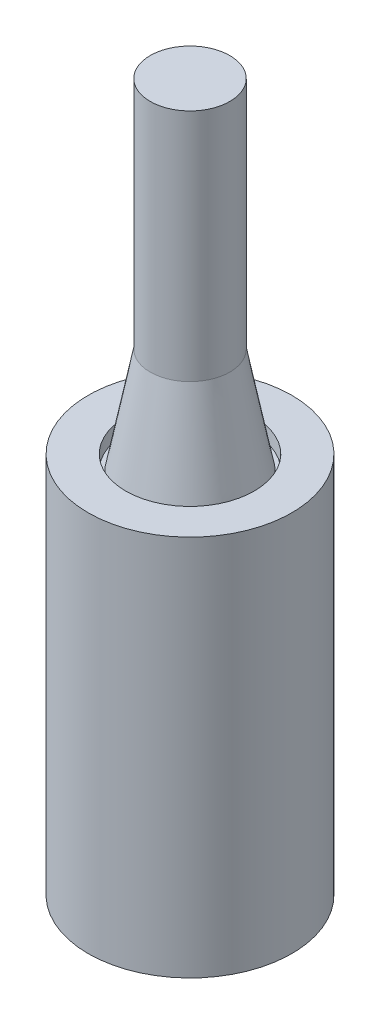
from build123d import *

# Parameters (mm, degrees)
SKETCH1_R      = 7.75
EXTRUDE1_DEPTH = 18.923
SKETCH2_R      = 6.55
EXTRUDE2_DEPTH = 11.43
EXTRUDE2_TAPER = 11
SKETCH3_R      = 4.328233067
EXTRUDE3_DEPTH = 25.5
SKETCH4_R      = 2.3114
EXTRUDE4_DEPTH = 6.35
SKETCH5_R      = 1.3716
EXTRUDE5_DEPTH = 6.35
SKETCH6_R      = 1.5875
EXTRUDE6_DEPTH = 12.7


with BuildPart() as part:
    # Sketch1 → Extrude1 (new body)
    with BuildSketch(Plane(origin=(0, 0, 0), x_dir=(1, 0, 0), z_dir=(0, 1, 0))):
        with Locations(Location((0, 0, 0), (0, 0, 270))):
            Circle(SKETCH1_R)
    extrude(amount=EXTRUDE1_DEPTH)

    # Sketch2 → Extrude2 (add)
    with BuildSketch(Plane(origin=(0, 18.923, 0), x_dir=(1, 0, 0), z_dir=(0, 1, 0))):
        Circle(SKETCH2_R)
    extrude(amount=EXTRUDE2_DEPTH, taper=EXTRUDE2_TAPER)

    # Sketch3 → Extrude3 (add)
    with BuildSketch(Plane(origin=(0, 30.353, 0), x_dir=(1, 0, 0), z_dir=(0, 1, 0))):
        with Locations(Location((0, 0, 0), (0, 0, 270))):
            Circle(SKETCH3_R)
    extrude(amount=EXTRUDE3_DEPTH)

    # Sketch4 → Extrude4 (add)
    with BuildSketch(Plane.XZ):
        with Locations(Location((3.81, 0, 0), (0, 0, 90))):
            Circle(SKETCH4_R)
        with Locations(Location((-3.81, 0, 0), (0, 0, 90))):
            Circle(SKETCH4_R)
    extrude(amount=EXTRUDE4_DEPTH)

    # Sketch5 → Extrude5 (add)
    with BuildSketch(Plane.XZ.offset(6.35)):
        with Locations(Location((-3.81, 0, 0), (0, 0, 270))):
            Circle(SKETCH5_R)
        with Locations(Location((3.81, 0, 0), (0, 0, 270))):
            Circle(SKETCH5_R)
    extrude(amount=EXTRUDE5_DEPTH)

    # Sketch6 → Extrude6 (add)
    with BuildSketch(Plane.XZ):
        with Locations(Location((0, 3.8481, 0), (0, 0, 90))):
            Circle(SKETCH6_R)
    extrude(amount=EXTRUDE6_DEPTH)

    # Sketch7 → LockRing (revolve)
    with BuildSketch(Plane.XY, mode=Mode.PRIVATE) as lockring_sk:
        Polygon((6.985, 18.923), (8.1534, 18.923), (8.1534, -21.051940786), (11.0744, -21.051940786), (11.0744, 20.477059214), (6.985, 20.477059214), align=None)
    revolve(lockring_sk.sketch.rotate(Axis((0, 0, 0), (0, -1, 0)), 90), axis=Axis((0, 0, 0), (0, -1, 0)))


solid = part.part
